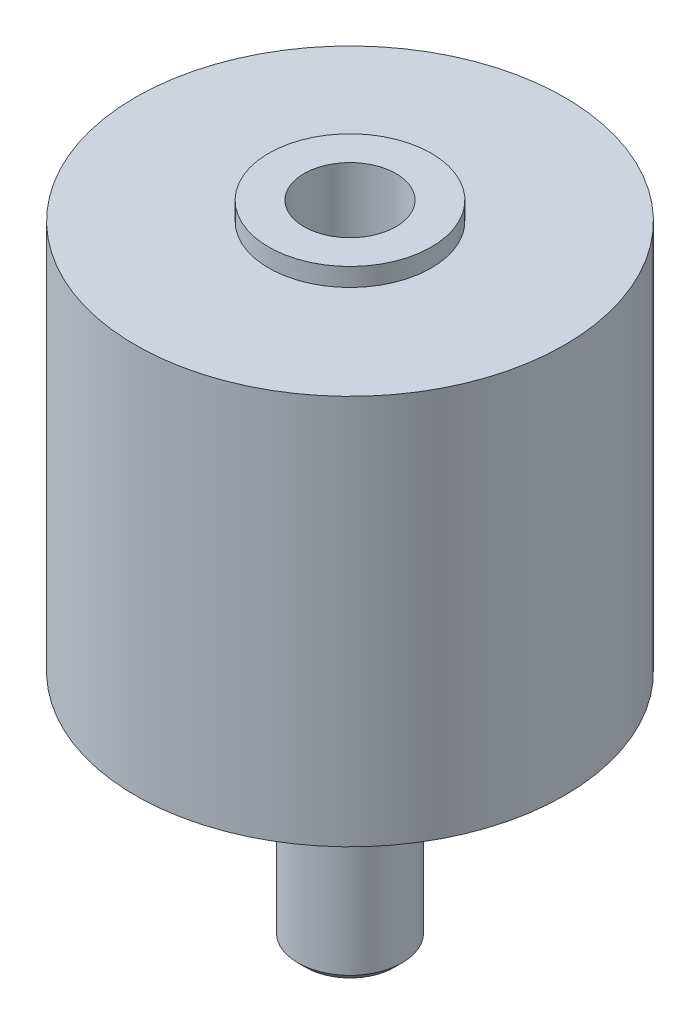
ISO-10303-21;
HEADER;
FILE_DESCRIPTION(('STEP AP214'),'2;1');
FILE_NAME('part.step','',(''),(''),'','','');
FILE_SCHEMA(('AUTOMOTIVE_DESIGN { 1 0 10303 214 1 1 1 1 }'));
ENDSEC;
DATA;
#1=APPLICATION_CONTEXT('core data for automotive mechanical design processes');
#2=APPLICATION_PROTOCOL_DEFINITION('international standard','automotive_design',2000,#1);
#3=PRODUCT_CONTEXT('',#1,'mechanical');
#4=PRODUCT('Part','Part','',(#3));
#5=PRODUCT_RELATED_PRODUCT_CATEGORY('part','',(#4));
#6=PRODUCT_DEFINITION_FORMATION('','',#4);
#7=PRODUCT_DEFINITION_CONTEXT('part definition',#1,'design');
#8=PRODUCT_DEFINITION('design','',#6,#7);
#9=PRODUCT_DEFINITION_SHAPE('','',#8);
#10=(LENGTH_UNIT() NAMED_UNIT(*) SI_UNIT(.MILLI.,.METRE.));
#11=(NAMED_UNIT(*) PLANE_ANGLE_UNIT() SI_UNIT($,.RADIAN.));
#12=(NAMED_UNIT(*) SI_UNIT($,.STERADIAN.) SOLID_ANGLE_UNIT());
#13=UNCERTAINTY_MEASURE_WITH_UNIT(LENGTH_MEASURE(1.E-05),#10,'distance_accuracy_value','');
#14=(GEOMETRIC_REPRESENTATION_CONTEXT(3) GLOBAL_UNCERTAINTY_ASSIGNED_CONTEXT((#13)) GLOBAL_UNIT_ASSIGNED_CONTEXT((#10,
#11,#12)) REPRESENTATION_CONTEXT('',''));
#15=CARTESIAN_POINT('',(0.,0.,0.));
#16=DIRECTION('',(0.,0.,1.));
#17=DIRECTION('',(1.,0.,0.));
#18=AXIS2_PLACEMENT_3D('',#15,#16,#17);
#19=CARTESIAN_POINT('',(-2.184908,-11.43,-2.184908));
#20=DIRECTION('',(0.,1.,0.));
#21=DIRECTION('',(0.,0.,1.));
#22=AXIS2_PLACEMENT_3D('',#19,#20,#21);
#23=PLANE('',#22);
#24=CARTESIAN_POINT('',(0.,-11.4300000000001,0.));
#25=DIRECTION('',(0.,1.,0.));
#26=DIRECTION('',(0.,0.,1.));
#27=AXIS2_PLACEMENT_3D('',#24,#25,#26);
#28=CIRCLE('',#27,2.15899999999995);
#29=CARTESIAN_POINT('',(0.,-11.4300000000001,2.15899999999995));
#30=VERTEX_POINT('',#29);
#31=EDGE_CURVE('E20',#30,#30,#28,.F.);
#32=ORIENTED_EDGE('',*,*,#31,.T.);
#33=EDGE_LOOP('',(#32));
#34=FACE_BOUND('',#33,.T.);
#35=ADVANCED_FACE('F16',(#34),#23,.F.);
#36=CARTESIAN_POINT('',(0.,-11.43,0.));
#37=DIRECTION('',(0.,1.,0.));
#38=DIRECTION('',(0.,0.,1.));
#39=AXIS2_PLACEMENT_3D('',#36,#37,#38);
#40=CONICAL_SURFACE('',#39,2.159,0.78539816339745);
#41=CARTESIAN_POINT('',(0.,-11.049,0.));
#42=DIRECTION('',(0.,1.,0.));
#43=DIRECTION('',(0.,0.,1.));
#44=AXIS2_PLACEMENT_3D('',#41,#42,#43);
#45=CIRCLE('',#44,2.54);
#46=CARTESIAN_POINT('',(0.,-11.049,2.54));
#47=VERTEX_POINT('',#46);
#48=EDGE_CURVE('E112',#47,#47,#45,.F.);
#49=ORIENTED_EDGE('',*,*,#48,.T.);
#50=EDGE_LOOP('',(#49));
#51=FACE_BOUND('',#50,.T.);
#52=ORIENTED_EDGE('',*,*,#31,.F.);
#53=EDGE_LOOP('',(#52));
#54=FACE_BOUND('',#53,.T.);
#55=ADVANCED_FACE('F64',(#51,#54),#40,.T.);
#56=CARTESIAN_POINT('',(0.,-11.049,0.));
#57=DIRECTION('',(0.,1.,0.));
#58=DIRECTION('',(0.,0.,1.));
#59=AXIS2_PLACEMENT_3D('',#56,#57,#58);
#60=CYLINDRICAL_SURFACE('',#59,2.54);
#61=CARTESIAN_POINT('',(0.,-2.159,0.));
#62=DIRECTION('',(0.,1.,0.));
#63=DIRECTION('',(0.,0.,1.));
#64=AXIS2_PLACEMENT_3D('',#61,#62,#63);
#65=CIRCLE('',#64,2.54);
#66=CARTESIAN_POINT('',(0.,-2.159,2.54));
#67=VERTEX_POINT('',#66);
#68=EDGE_CURVE('E109',#67,#67,#65,.T.);
#69=ORIENTED_EDGE('',*,*,#68,.F.);
#70=EDGE_LOOP('',(#69));
#71=FACE_BOUND('',#70,.T.);
#72=ORIENTED_EDGE('',*,*,#48,.F.);
#73=EDGE_LOOP('',(#72));
#74=FACE_BOUND('',#73,.T.);
#75=ADVANCED_FACE('F61',(#71,#74),#60,.T.);
#76=CARTESIAN_POINT('',(-2.827528,-2.159,2.827528));
#77=DIRECTION('',(0.,-1.,0.));
#78=DIRECTION('',(0.,0.,-1.));
#79=AXIS2_PLACEMENT_3D('',#76,#77,#78);
#80=PLANE('',#79);
#81=ORIENTED_EDGE('',*,*,#68,.T.);
#82=EDGE_LOOP('',(#81));
#83=FACE_BOUND('',#82,.T.);
#84=CARTESIAN_POINT('',(0.,-2.159,0.));
#85=DIRECTION('',(0.,1.,0.));
#86=DIRECTION('',(0.,0.,1.));
#87=AXIS2_PLACEMENT_3D('',#84,#85,#86);
#88=CIRCLE('',#87,2.794);
#89=CARTESIAN_POINT('',(0.,-2.159,2.794));
#90=VERTEX_POINT('',#89);
#91=EDGE_CURVE('E106',#90,#90,#88,.F.);
#92=ORIENTED_EDGE('',*,*,#91,.T.);
#93=EDGE_LOOP('',(#92));
#94=FACE_BOUND('',#93,.T.);
#95=ADVANCED_FACE('F59',(#83,#94),#80,.T.);
#96=CARTESIAN_POINT('',(0.,-2.159,0.));
#97=DIRECTION('',(0.,1.,0.));
#98=DIRECTION('',(0.,0.,1.));
#99=AXIS2_PLACEMENT_3D('',#96,#97,#98);
#100=CYLINDRICAL_SURFACE('',#99,2.794);
#101=ORIENTED_EDGE('',*,*,#91,.F.);
#102=EDGE_LOOP('',(#101));
#103=FACE_BOUND('',#102,.T.);
#104=CARTESIAN_POINT('',(0.,0.,0.));
#105=DIRECTION('',(0.,1.,0.));
#106=DIRECTION('',(0.,0.,1.));
#107=AXIS2_PLACEMENT_3D('',#104,#105,#106);
#108=CIRCLE('',#107,2.794);
#109=CARTESIAN_POINT('',(0.,0.,2.794));
#110=VERTEX_POINT('',#109);
#111=EDGE_CURVE('E99',#110,#110,#108,.F.);
#112=ORIENTED_EDGE('',*,*,#111,.T.);
#113=EDGE_LOOP('',(#112));
#114=FACE_BOUND('',#113,.T.);
#115=ADVANCED_FACE('F56',(#103,#114),#100,.T.);
#116=CARTESIAN_POINT('',(-10.60323,0.,-10.60323));
#117=DIRECTION('',(0.,1.,0.));
#118=DIRECTION('',(0.,0.,1.));
#119=AXIS2_PLACEMENT_3D('',#116,#117,#118);
#120=PLANE('',#119);
#121=ORIENTED_EDGE('',*,*,#111,.F.);
#122=EDGE_LOOP('',(#121));
#123=FACE_BOUND('',#122,.T.);
#124=CARTESIAN_POINT('',(0.,0.,0.));
#125=DIRECTION('',(0.,-1.,0.));
#126=DIRECTION('',(1.,0.,0.));
#127=AXIS2_PLACEMENT_3D('',#124,#125,#126);
#128=CIRCLE('',#127,10.4775);
#129=CARTESIAN_POINT('',(10.4775,0.,0.));
#130=VERTEX_POINT('',#129);
#131=EDGE_CURVE('E90',#130,#130,#128,.T.);
#132=ORIENTED_EDGE('',*,*,#131,.T.);
#133=EDGE_LOOP('',(#132));
#134=FACE_BOUND('',#133,.T.);
#135=ADVANCED_FACE('F54',(#123,#134),#120,.F.);
#136=CARTESIAN_POINT('',(0.,19.05,0.));
#137=DIRECTION('',(0.,-1.,0.));
#138=DIRECTION('',(1.,0.,0.));
#139=AXIS2_PLACEMENT_3D('',#136,#137,#138);
#140=CYLINDRICAL_SURFACE('',#139,10.4775);
#141=ORIENTED_EDGE('',*,*,#131,.F.);
#142=EDGE_LOOP('',(#141));
#143=FACE_BOUND('',#142,.T.);
#144=CARTESIAN_POINT('',(0.,19.05,0.));
#145=DIRECTION('',(0.,-1.,0.));
#146=DIRECTION('',(1.,0.,0.));
#147=AXIS2_PLACEMENT_3D('',#144,#145,#146);
#148=CIRCLE('',#147,10.4775);
#149=CARTESIAN_POINT('',(10.4775,19.05,0.));
#150=VERTEX_POINT('',#149);
#151=EDGE_CURVE('E87',#150,#150,#148,.F.);
#152=ORIENTED_EDGE('',*,*,#151,.F.);
#153=EDGE_LOOP('',(#152));
#154=FACE_BOUND('',#153,.T.);
#155=ADVANCED_FACE('F51',(#143,#154),#140,.T.);
#156=CARTESIAN_POINT('',(-10.60323,19.05,-10.60323));
#157=DIRECTION('',(0.,1.,0.));
#158=DIRECTION('',(0.,0.,1.));
#159=AXIS2_PLACEMENT_3D('',#156,#157,#158);
#160=PLANE('',#159);
#161=CARTESIAN_POINT('',(0.,19.05,0.));
#162=DIRECTION('',(0.,-1.,0.));
#163=DIRECTION('',(0.,0.,-1.));
#164=AXIS2_PLACEMENT_3D('',#161,#162,#163);
#165=CIRCLE('',#164,3.96875);
#166=CARTESIAN_POINT('',(0.,19.05,-3.96875));
#167=VERTEX_POINT('',#166);
#168=EDGE_CURVE('E84',#167,#167,#165,.T.);
#169=ORIENTED_EDGE('',*,*,#168,.T.);
#170=EDGE_LOOP('',(#169));
#171=FACE_BOUND('',#170,.T.);
#172=ORIENTED_EDGE('',*,*,#151,.T.);
#173=EDGE_LOOP('',(#172));
#174=FACE_BOUND('',#173,.T.);
#175=ADVANCED_FACE('F49',(#171,#174),#160,.T.);
#176=CARTESIAN_POINT('',(0.,19.939,0.));
#177=DIRECTION('',(0.,-1.,0.));
#178=DIRECTION('',(0.,0.,-1.));
#179=AXIS2_PLACEMENT_3D('',#176,#177,#178);
#180=CYLINDRICAL_SURFACE('',#179,3.96875);
#181=ORIENTED_EDGE('',*,*,#168,.F.);
#182=EDGE_LOOP('',(#181));
#183=FACE_BOUND('',#182,.T.);
#184=CARTESIAN_POINT('',(0.,19.939,0.));
#185=DIRECTION('',(0.,-1.,0.));
#186=DIRECTION('',(0.,0.,-1.));
#187=AXIS2_PLACEMENT_3D('',#184,#185,#186);
#188=CIRCLE('',#187,3.96875);
#189=CARTESIAN_POINT('',(0.,19.939,-3.96875));
#190=VERTEX_POINT('',#189);
#191=EDGE_CURVE('E96',#190,#190,#188,.F.);
#192=ORIENTED_EDGE('',*,*,#191,.F.);
#193=EDGE_LOOP('',(#192));
#194=FACE_BOUND('',#193,.T.);
#195=ADVANCED_FACE('F43',(#183,#194),#180,.T.);
#196=CARTESIAN_POINT('',(-4.016375,19.939,-4.016375));
#197=DIRECTION('',(0.,1.,0.));
#198=DIRECTION('',(0.,0.,1.));
#199=AXIS2_PLACEMENT_3D('',#196,#197,#198);
#200=PLANE('',#199);
#201=CARTESIAN_POINT('',(0.,19.939,0.));
#202=DIRECTION('',(0.,1.,0.));
#203=DIRECTION('',(0.,0.,1.));
#204=AXIS2_PLACEMENT_3D('',#201,#202,#203);
#205=CIRCLE('',#204,2.2479);
#206=CARTESIAN_POINT('',(0.,19.939,2.2479));
#207=VERTEX_POINT('',#206);
#208=EDGE_CURVE('E25',#207,#207,#205,.T.);
#209=ORIENTED_EDGE('',*,*,#208,.F.);
#210=EDGE_LOOP('',(#209));
#211=FACE_BOUND('',#210,.T.);
#212=ORIENTED_EDGE('',*,*,#191,.T.);
#213=EDGE_LOOP('',(#212));
#214=FACE_BOUND('',#213,.T.);
#215=ADVANCED_FACE('F18',(#211,#214),#200,.T.);
#216=CARTESIAN_POINT('',(0.,5.719,0.));
#217=DIRECTION('',(0.,1.,0.));
#218=DIRECTION('',(0.,0.,1.));
#219=AXIS2_PLACEMENT_3D('',#216,#217,#218);
#220=CYLINDRICAL_SURFACE('',#219,2.2479);
#221=ORIENTED_EDGE('',*,*,#208,.T.);
#222=EDGE_LOOP('',(#221));
#223=FACE_BOUND('',#222,.T.);
#224=CARTESIAN_POINT('',(0.,5.71899999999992,0.));
#225=DIRECTION('',(0.,1.,0.));
#226=DIRECTION('',(0.,0.,1.));
#227=AXIS2_PLACEMENT_3D('',#224,#225,#226);
#228=CIRCLE('',#227,2.2479);
#229=CARTESIAN_POINT('',(0.,5.719,2.2479));
#230=VERTEX_POINT('',#229);
#231=EDGE_CURVE('E11',#230,#230,#228,.T.);
#232=ORIENTED_EDGE('',*,*,#231,.F.);
#233=EDGE_LOOP('',(#232));
#234=FACE_BOUND('',#233,.T.);
#235=ADVANCED_FACE('F32',(#223,#234),#220,.F.);
#236=CARTESIAN_POINT('',(0.,4.368325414,0.));
#237=DIRECTION('',(0.,1.,0.));
#238=DIRECTION('',(0.,0.,1.));
#239=AXIS2_PLACEMENT_3D('',#236,#237,#238);
#240=CONICAL_SURFACE('',#239,0.,1.02974425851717);
#241=CARTESIAN_POINT('',(0.,4.368325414,0.));
#242=VERTEX_POINT('',#241);
#243=VERTEX_LOOP('',#242);
#244=FACE_BOUND('',#243,.T.);
#245=ORIENTED_EDGE('',*,*,#231,.T.);
#246=EDGE_LOOP('',(#245));
#247=FACE_BOUND('',#246,.T.);
#248=ADVANCED_FACE('F29',(#244,#247),#240,.F.);
#249=CLOSED_SHELL('',(#35,#55,#75,#95,#115,#135,#155,#175,#195,#215,#235,#248));
#250=MANIFOLD_SOLID_BREP('B1',#249);
#251=ADVANCED_BREP_SHAPE_REPRESENTATION('',(#18,#250),#14);
#252=SHAPE_DEFINITION_REPRESENTATION(#9,#251);
ENDSEC;
END-ISO-10303-21;
